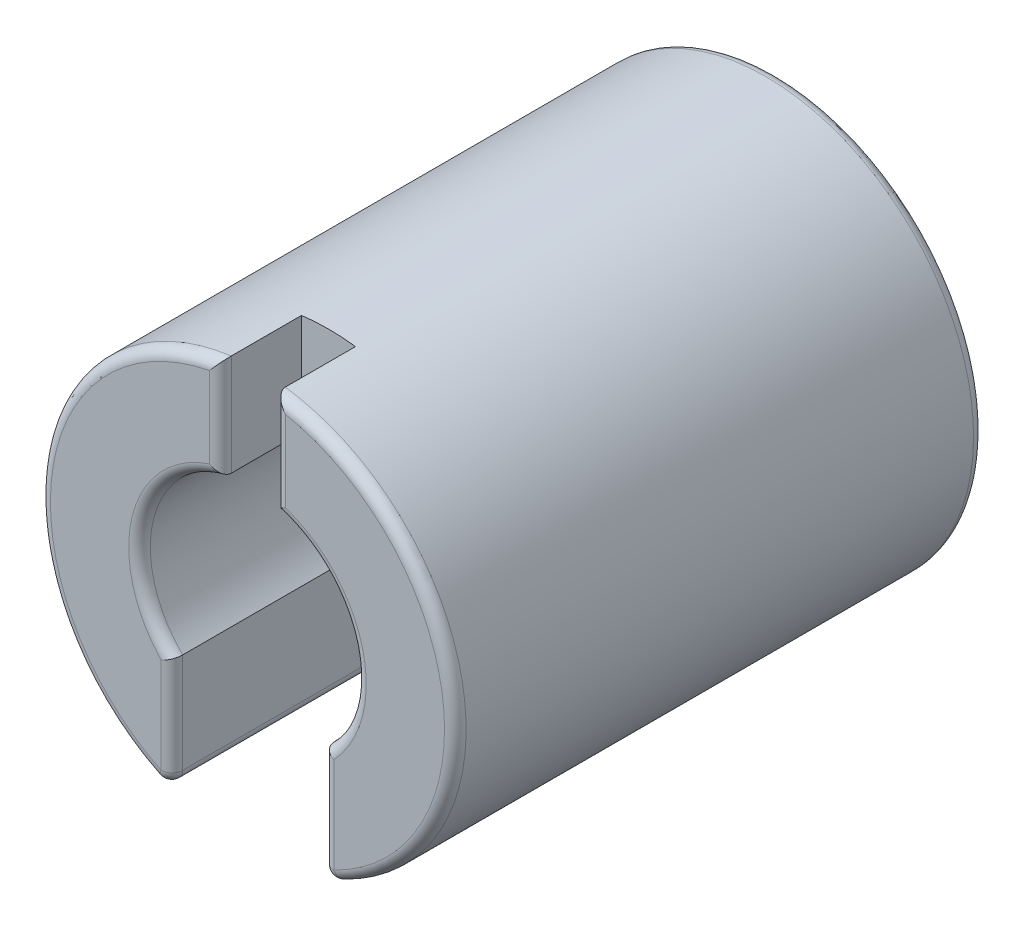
ISO-10303-21;
HEADER;
FILE_DESCRIPTION(('STEP AP214'),'2;1');
FILE_NAME('part.step','',(''),(''),'','','');
FILE_SCHEMA(('AUTOMOTIVE_DESIGN { 1 0 10303 214 1 1 1 1 }'));
ENDSEC;
DATA;
#1=APPLICATION_CONTEXT('core data for automotive mechanical design processes');
#2=APPLICATION_PROTOCOL_DEFINITION('international standard','automotive_design',2000,#1);
#3=PRODUCT_CONTEXT('',#1,'mechanical');
#4=PRODUCT('Part','Part','',(#3));
#5=PRODUCT_RELATED_PRODUCT_CATEGORY('part','',(#4));
#6=PRODUCT_DEFINITION_FORMATION('','',#4);
#7=PRODUCT_DEFINITION_CONTEXT('part definition',#1,'design');
#8=PRODUCT_DEFINITION('design','',#6,#7);
#9=PRODUCT_DEFINITION_SHAPE('','',#8);
#10=(LENGTH_UNIT() NAMED_UNIT(*) SI_UNIT(.MILLI.,.METRE.));
#11=(NAMED_UNIT(*) PLANE_ANGLE_UNIT() SI_UNIT($,.RADIAN.));
#12=(NAMED_UNIT(*) SI_UNIT($,.STERADIAN.) SOLID_ANGLE_UNIT());
#13=UNCERTAINTY_MEASURE_WITH_UNIT(LENGTH_MEASURE(1.E-05),#10,'distance_accuracy_value','');
#14=(GEOMETRIC_REPRESENTATION_CONTEXT(3) GLOBAL_UNCERTAINTY_ASSIGNED_CONTEXT((#13)) GLOBAL_UNIT_ASSIGNED_CONTEXT((#10,
#11,#12)) REPRESENTATION_CONTEXT('',''));
#15=CARTESIAN_POINT('',(0.,0.,0.));
#16=DIRECTION('',(0.,0.,1.));
#17=DIRECTION('',(1.,0.,0.));
#18=AXIS2_PLACEMENT_3D('',#15,#16,#17);
#19=CARTESIAN_POINT('',(0.,0.,9.8));
#20=DIRECTION('',(0.,0.,-1.));
#21=DIRECTION('',(-1.,0.,0.));
#22=AXIS2_PLACEMENT_3D('',#19,#20,#21);
#23=CYLINDRICAL_SURFACE('',#22,2.);
#24=DIRECTION('',(0.,0.,-1.));
#25=VECTOR('',#24,1.);
#26=CARTESIAN_POINT('',(1.4,-1.42828568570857,9.8));
#27=LINE('',#26,#25);
#28=CARTESIAN_POINT('',(1.4,-1.42828568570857,9.6));
#29=VERTEX_POINT('',#28);
#30=CARTESIAN_POINT('',(1.4,-1.42828568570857,0.));
#31=VERTEX_POINT('',#30);
#32=EDGE_CURVE('E213',#29,#31,#27,.T.);
#33=ORIENTED_EDGE('',*,*,#32,.F.);
#34=CARTESIAN_POINT('',(0.,0.,9.6));
#35=DIRECTION('',(0.,0.,1.));
#36=DIRECTION('',(1.,0.,0.));
#37=AXIS2_PLACEMENT_3D('',#34,#35,#36);
#38=CIRCLE('',#37,2.);
#39=CARTESIAN_POINT('',(0.5,1.93649167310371,9.6));
#40=VERTEX_POINT('',#39);
#41=EDGE_CURVE('E263',#29,#40,#38,.T.);
#42=ORIENTED_EDGE('',*,*,#41,.T.);
#43=DIRECTION('',(0.,0.,1.));
#44=VECTOR('',#43,1.);
#45=CARTESIAN_POINT('',(0.5,1.93649167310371,8.3));
#46=LINE('',#45,#44);
#47=CARTESIAN_POINT('',(0.5,1.93649167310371,0.));
#48=VERTEX_POINT('',#47);
#49=EDGE_CURVE('E432',#48,#40,#46,.T.);
#50=ORIENTED_EDGE('',*,*,#49,.F.);
#51=CARTESIAN_POINT('',(0.,0.,0.));
#52=DIRECTION('',(0.,0.,-1.));
#53=DIRECTION('',(1.,0.,0.));
#54=AXIS2_PLACEMENT_3D('',#51,#52,#53);
#55=CIRCLE('',#54,2.);
#56=EDGE_CURVE('E210',#48,#31,#55,.T.);
#57=ORIENTED_EDGE('',*,*,#56,.T.);
#58=EDGE_LOOP('',(#33,#42,#50,#57));
#59=FACE_BOUND('',#58,.T.);
#60=ADVANCED_FACE('F36',(#59),#23,.F.);
#61=CARTESIAN_POINT('',(0.,0.,9.8));
#62=DIRECTION('',(0.,0.,1.));
#63=DIRECTION('',(1.,0.,0.));
#64=AXIS2_PLACEMENT_3D('',#61,#62,#63);
#65=PLANE('',#64);
#66=DIRECTION('',(0.,1.,0.));
#67=VECTOR('',#66,1.);
#68=CARTESIAN_POINT('',(-1.6,-1.42828568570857,9.8));
#69=LINE('',#68,#67);
#70=CARTESIAN_POINT('',(-1.59999999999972,-3.28062494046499,9.8));
#71=VERTEX_POINT('',#70);
#72=CARTESIAN_POINT('',(-1.6,-1.50996688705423,9.8));
#73=VERTEX_POINT('',#72);
#74=EDGE_CURVE('E228',#71,#73,#69,.T.);
#75=ORIENTED_EDGE('',*,*,#74,.T.);
#76=CARTESIAN_POINT('',(0.,0.,9.8));
#77=DIRECTION('',(0.,0.,1.));
#78=DIRECTION('',(1.,0.,0.));
#79=AXIS2_PLACEMENT_3D('',#76,#77,#78);
#80=CIRCLE('',#79,2.2);
#81=CARTESIAN_POINT('',(-0.7,2.08566536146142,9.8));
#82=VERTEX_POINT('',#81);
#83=EDGE_CURVE('E230',#73,#82,#80,.F.);
#84=ORIENTED_EDGE('',*,*,#83,.T.);
#85=DIRECTION('',(0.,-1.,0.));
#86=VECTOR('',#85,1.);
#87=CARTESIAN_POINT('',(-0.7,3.81739439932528,9.8));
#88=LINE('',#87,#86);
#89=CARTESIAN_POINT('',(-0.7,3.58224789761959,9.8));
#90=VERTEX_POINT('',#89);
#91=EDGE_CURVE('E224',#82,#90,#88,.F.);
#92=ORIENTED_EDGE('',*,*,#91,.T.);
#93=CARTESIAN_POINT('',(0.,0.,9.8));
#94=DIRECTION('',(0.,0.,1.));
#95=DIRECTION('',(1.,0.,0.));
#96=AXIS2_PLACEMENT_3D('',#93,#94,#95);
#97=CIRCLE('',#96,3.65);
#98=EDGE_CURVE('E226',#90,#71,#97,.T.);
#99=ORIENTED_EDGE('',*,*,#98,.T.);
#100=EDGE_LOOP('',(#75,#84,#92,#99));
#101=FACE_BOUND('',#100,.T.);
#102=ADVANCED_FACE('F377',(#101),#65,.T.);
#103=CARTESIAN_POINT('',(0.,0.,9.8));
#104=DIRECTION('',(0.,0.,-1.));
#105=DIRECTION('',(-1.,0.,0.));
#106=AXIS2_PLACEMENT_3D('',#103,#104,#105);
#107=CYLINDRICAL_SURFACE('',#106,3.85);
#108=DIRECTION('',(0.,0.,-1.));
#109=VECTOR('',#108,1.);
#110=CARTESIAN_POINT('',(-1.68767123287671,-3.46038521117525,9.8));
#111=LINE('',#110,#109);
#112=CARTESIAN_POINT('',(-1.68767123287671,-3.46038521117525,0.200000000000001));
#113=VERTEX_POINT('',#112);
#114=CARTESIAN_POINT('',(-1.68767123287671,-3.46038521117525,9.6));
#115=VERTEX_POINT('',#114);
#116=EDGE_CURVE('E241',#113,#115,#111,.F.);
#117=ORIENTED_EDGE('',*,*,#116,.T.);
#118=CARTESIAN_POINT('',(0.,0.,9.6));
#119=DIRECTION('',(0.,0.,1.));
#120=DIRECTION('',(1.,0.,0.));
#121=AXIS2_PLACEMENT_3D('',#118,#119,#120);
#122=CIRCLE('',#121,3.85);
#123=CARTESIAN_POINT('',(-0.5,3.81739439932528,9.6));
#124=VERTEX_POINT('',#123);
#125=EDGE_CURVE('E247',#115,#124,#122,.F.);
#126=ORIENTED_EDGE('',*,*,#125,.T.);
#127=DIRECTION('',(0.,0.,1.));
#128=VECTOR('',#127,1.);
#129=CARTESIAN_POINT('',(-0.5,3.81739439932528,8.3));
#130=LINE('',#129,#128);
#131=CARTESIAN_POINT('',(-0.5,3.81739439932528,8.3));
#132=VERTEX_POINT('',#131);
#133=EDGE_CURVE('E196',#132,#124,#130,.T.);
#134=ORIENTED_EDGE('',*,*,#133,.F.);
#135=CARTESIAN_POINT('',(0.,0.,8.3));
#136=DIRECTION('',(0.,0.,1.));
#137=DIRECTION('',(1.,0.,0.));
#138=AXIS2_PLACEMENT_3D('',#135,#136,#137);
#139=CIRCLE('',#138,3.85);
#140=CARTESIAN_POINT('',(0.5,3.81739439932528,8.3));
#141=VERTEX_POINT('',#140);
#142=EDGE_CURVE('E439',#141,#132,#139,.T.);
#143=ORIENTED_EDGE('',*,*,#142,.F.);
#144=DIRECTION('',(0.,0.,1.));
#145=VECTOR('',#144,1.);
#146=CARTESIAN_POINT('',(0.5,3.81739439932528,8.3));
#147=LINE('',#146,#145);
#148=CARTESIAN_POINT('',(0.5,3.81739439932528,9.6));
#149=VERTEX_POINT('',#148);
#150=EDGE_CURVE('E429',#141,#149,#147,.T.);
#151=ORIENTED_EDGE('',*,*,#150,.T.);
#152=CARTESIAN_POINT('',(0.,0.,9.6));
#153=DIRECTION('',(0.,0.,1.));
#154=DIRECTION('',(1.,0.,0.));
#155=AXIS2_PLACEMENT_3D('',#152,#153,#154);
#156=CIRCLE('',#155,3.85);
#157=CARTESIAN_POINT('',(1.68767123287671,-3.46038521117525,9.6));
#158=VERTEX_POINT('',#157);
#159=EDGE_CURVE('E245',#149,#158,#156,.F.);
#160=ORIENTED_EDGE('',*,*,#159,.T.);
#161=DIRECTION('',(0.,0.,-1.));
#162=VECTOR('',#161,1.);
#163=CARTESIAN_POINT('',(1.68767123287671,-3.46038521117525,9.8));
#164=LINE('',#163,#162);
#165=CARTESIAN_POINT('',(1.68767123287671,-3.46038521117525,0.200000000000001));
#166=VERTEX_POINT('',#165);
#167=EDGE_CURVE('E243',#158,#166,#164,.T.);
#168=ORIENTED_EDGE('',*,*,#167,.T.);
#169=CARTESIAN_POINT('',(0.,0.,0.200000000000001));
#170=DIRECTION('',(0.,0.,1.));
#171=DIRECTION('',(1.,0.,0.));
#172=AXIS2_PLACEMENT_3D('',#169,#170,#171);
#173=CIRCLE('',#172,3.85);
#174=EDGE_CURVE('E239',#166,#113,#173,.T.);
#175=ORIENTED_EDGE('',*,*,#174,.T.);
#176=EDGE_LOOP('',(#117,#126,#134,#143,#151,#160,#168,#175));
#177=FACE_BOUND('',#176,.T.);
#178=ADVANCED_FACE('F383',(#177),#107,.T.);
#179=CARTESIAN_POINT('',(-1.4,-3.58643276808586,9.8));
#180=DIRECTION('',(-1.,0.,0.));
#181=DIRECTION('',(0.,0.,1.));
#182=AXIS2_PLACEMENT_3D('',#179,#180,#181);
#183=PLANE('',#182);
#184=DIRECTION('',(0.,0.,-1.));
#185=VECTOR('',#184,1.);
#186=CARTESIAN_POINT('',(-1.4,-1.42828568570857,9.8));
#187=LINE('',#186,#185);
#188=CARTESIAN_POINT('',(-1.4,-1.42828568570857,9.6));
#189=VERTEX_POINT('',#188);
#190=CARTESIAN_POINT('',(-1.4,-1.42828568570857,0.));
#191=VERTEX_POINT('',#190);
#192=EDGE_CURVE('E208',#189,#191,#187,.T.);
#193=ORIENTED_EDGE('',*,*,#192,.F.);
#194=DIRECTION('',(0.,1.,0.));
#195=VECTOR('',#194,1.);
#196=CARTESIAN_POINT('',(-1.4,-3.58643276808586,9.6));
#197=LINE('',#196,#195);
#198=CARTESIAN_POINT('',(-1.4,-3.28062494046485,9.6));
#199=VERTEX_POINT('',#198);
#200=EDGE_CURVE('E237',#189,#199,#197,.F.);
#201=ORIENTED_EDGE('',*,*,#200,.T.);
#202=DIRECTION('',(0.,0.,-1.));
#203=VECTOR('',#202,1.);
#204=CARTESIAN_POINT('',(-1.4,-3.28062494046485,9.8));
#205=LINE('',#204,#203);
#206=CARTESIAN_POINT('',(-1.4,-3.28062494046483,0.));
#207=VERTEX_POINT('',#206);
#208=EDGE_CURVE('E235',#199,#207,#205,.T.);
#209=ORIENTED_EDGE('',*,*,#208,.T.);
#210=DIRECTION('',(0.,1.,0.));
#211=VECTOR('',#210,1.);
#212=CARTESIAN_POINT('',(-1.4,-3.58643276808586,0.));
#213=LINE('',#212,#211);
#214=EDGE_CURVE('E195',#207,#191,#213,.T.);
#215=ORIENTED_EDGE('',*,*,#214,.T.);
#216=EDGE_LOOP('',(#193,#201,#209,#215));
#217=FACE_BOUND('',#216,.T.);
#218=ADVANCED_FACE('F392',(#217),#183,.F.);
#219=DIRECTION('',(0.,0.,1.));
#220=VECTOR('',#219,1.);
#221=CARTESIAN_POINT('',(-0.5,1.93649167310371,8.3));
#222=LINE('',#221,#220);
#223=CARTESIAN_POINT('',(-0.5,1.93649167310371,0.));
#224=VERTEX_POINT('',#223);
#225=CARTESIAN_POINT('',(-0.5,1.93649167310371,9.6));
#226=VERTEX_POINT('',#225);
#227=EDGE_CURVE('E183',#224,#226,#222,.T.);
#228=ORIENTED_EDGE('',*,*,#227,.T.);
#229=CARTESIAN_POINT('',(0.,0.,9.6));
#230=DIRECTION('',(0.,0.,1.));
#231=DIRECTION('',(1.,0.,0.));
#232=AXIS2_PLACEMENT_3D('',#229,#230,#231);
#233=CIRCLE('',#232,2.);
#234=EDGE_CURVE('E233',#226,#189,#233,.T.);
#235=ORIENTED_EDGE('',*,*,#234,.T.);
#236=ORIENTED_EDGE('',*,*,#192,.T.);
#237=EDGE_CURVE('E200',#191,#224,#55,.T.);
#238=ORIENTED_EDGE('',*,*,#237,.T.);
#239=EDGE_LOOP('',(#228,#235,#236,#238));
#240=FACE_BOUND('',#239,.T.);
#241=ADVANCED_FACE('F206',(#240),#23,.F.);
#242=CARTESIAN_POINT('',(1.4,-3.58643276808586,9.8));
#243=DIRECTION('',(1.,0.,0.));
#244=DIRECTION('',(0.,0.,-1.));
#245=AXIS2_PLACEMENT_3D('',#242,#243,#244);
#246=PLANE('',#245);
#247=DIRECTION('',(0.,0.,-1.));
#248=VECTOR('',#247,1.);
#249=CARTESIAN_POINT('',(1.4,-3.28062494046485,9.8));
#250=LINE('',#249,#248);
#251=CARTESIAN_POINT('',(1.4,-3.28062494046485,0.));
#252=VERTEX_POINT('',#251);
#253=CARTESIAN_POINT('',(1.4,-3.28062494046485,9.6));
#254=VERTEX_POINT('',#253);
#255=EDGE_CURVE('E259',#252,#254,#250,.F.);
#256=ORIENTED_EDGE('',*,*,#255,.T.);
#257=DIRECTION('',(0.,-1.,0.));
#258=VECTOR('',#257,1.);
#259=CARTESIAN_POINT('',(1.4,-1.42828568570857,9.6));
#260=LINE('',#259,#258);
#261=EDGE_CURVE('E261',#254,#29,#260,.F.);
#262=ORIENTED_EDGE('',*,*,#261,.T.);
#263=ORIENTED_EDGE('',*,*,#32,.T.);
#264=DIRECTION('',(0.,-1.,0.));
#265=VECTOR('',#264,1.);
#266=CARTESIAN_POINT('',(1.4,-3.58643276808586,0.));
#267=LINE('',#266,#265);
#268=EDGE_CURVE('E209',#31,#252,#267,.T.);
#269=ORIENTED_EDGE('',*,*,#268,.T.);
#270=EDGE_LOOP('',(#256,#262,#263,#269));
#271=FACE_BOUND('',#270,.T.);
#272=ADVANCED_FACE('F391',(#271),#246,.F.);
#273=DIRECTION('',(0.,-1.,0.));
#274=VECTOR('',#273,1.);
#275=CARTESIAN_POINT('',(1.6,-3.58643276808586,9.8));
#276=LINE('',#275,#274);
#277=CARTESIAN_POINT('',(1.59999999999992,-1.50996688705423,9.8));
#278=VERTEX_POINT('',#277);
#279=CARTESIAN_POINT('',(1.6,-3.28062494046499,9.8));
#280=VERTEX_POINT('',#279);
#281=EDGE_CURVE('E254',#278,#280,#276,.T.);
#282=ORIENTED_EDGE('',*,*,#281,.T.);
#283=CARTESIAN_POINT('',(0.,0.,9.8));
#284=DIRECTION('',(0.,0.,1.));
#285=DIRECTION('',(1.,0.,0.));
#286=AXIS2_PLACEMENT_3D('',#283,#284,#285);
#287=CIRCLE('',#286,3.65);
#288=CARTESIAN_POINT('',(0.7,3.58224789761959,9.8));
#289=VERTEX_POINT('',#288);
#290=EDGE_CURVE('E256',#280,#289,#287,.T.);
#291=ORIENTED_EDGE('',*,*,#290,.T.);
#292=DIRECTION('',(0.,1.,0.));
#293=VECTOR('',#292,1.);
#294=CARTESIAN_POINT('',(0.7,1.93649167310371,9.8));
#295=LINE('',#294,#293);
#296=CARTESIAN_POINT('',(0.7,2.08566536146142,9.8));
#297=VERTEX_POINT('',#296);
#298=EDGE_CURVE('E250',#289,#297,#295,.F.);
#299=ORIENTED_EDGE('',*,*,#298,.T.);
#300=CARTESIAN_POINT('',(0.,0.,9.8));
#301=DIRECTION('',(0.,0.,1.));
#302=DIRECTION('',(1.,0.,0.));
#303=AXIS2_PLACEMENT_3D('',#300,#301,#302);
#304=CIRCLE('',#303,2.2);
#305=EDGE_CURVE('E252',#297,#278,#304,.F.);
#306=ORIENTED_EDGE('',*,*,#305,.T.);
#307=EDGE_LOOP('',(#282,#291,#299,#306));
#308=FACE_BOUND('',#307,.T.);
#309=ADVANCED_FACE('F386',(#308),#65,.T.);
#310=CARTESIAN_POINT('',(0.,0.,0.));
#311=DIRECTION('',(0.,0.,1.));
#312=DIRECTION('',(1.,0.,0.));
#313=AXIS2_PLACEMENT_3D('',#310,#311,#312);
#314=PLANE('',#313);
#315=DIRECTION('',(-0.707106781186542,0.707106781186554,0.));
#316=VECTOR('',#315,1.);
#317=CARTESIAN_POINT('',(1.76776695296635,-1.76776695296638,0.));
#318=LINE('',#317,#316);
#319=CARTESIAN_POINT('',(2.4748737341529,-2.47487373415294,0.));
#320=VERTEX_POINT('',#319);
#321=CARTESIAN_POINT('',(1.76776695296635,-1.76776695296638,0.));
#322=VERTEX_POINT('',#321);
#323=EDGE_CURVE('E463',#320,#322,#318,.T.);
#324=ORIENTED_EDGE('',*,*,#323,.F.);
#325=CARTESIAN_POINT('',(0.,0.,0.));
#326=DIRECTION('',(0.,0.,-1.));
#327=DIRECTION('',(-1.,0.,0.));
#328=AXIS2_PLACEMENT_3D('',#325,#326,#327);
#329=CIRCLE('',#328,3.5);
#330=CARTESIAN_POINT('',(-2.47487373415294,-2.4748737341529,0.));
#331=VERTEX_POINT('',#330);
#332=EDGE_CURVE('E466',#331,#320,#329,.T.);
#333=ORIENTED_EDGE('',*,*,#332,.F.);
#334=DIRECTION('',(-0.707106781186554,-0.707106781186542,0.));
#335=VECTOR('',#334,1.);
#336=CARTESIAN_POINT('',(-1.76776695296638,-1.76776695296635,0.));
#337=LINE('',#336,#335);
#338=CARTESIAN_POINT('',(-1.76776695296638,-1.76776695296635,0.));
#339=VERTEX_POINT('',#338);
#340=EDGE_CURVE('E456',#339,#331,#337,.T.);
#341=ORIENTED_EDGE('',*,*,#340,.F.);
#342=CARTESIAN_POINT('',(0.,0.,0.));
#343=DIRECTION('',(0.,0.,1.));
#344=DIRECTION('',(-1.,0.,0.));
#345=AXIS2_PLACEMENT_3D('',#342,#343,#344);
#346=CIRCLE('',#345,2.5);
#347=EDGE_CURVE('E460',#322,#339,#346,.T.);
#348=ORIENTED_EDGE('',*,*,#347,.F.);
#349=EDGE_LOOP('',(#324,#333,#341,#348));
#350=FACE_BOUND('',#349,.T.);
#351=CARTESIAN_POINT('',(0.,0.,0.));
#352=DIRECTION('',(0.,0.,1.));
#353=DIRECTION('',(1.,0.,0.));
#354=AXIS2_PLACEMENT_3D('',#351,#352,#353);
#355=CIRCLE('',#354,3.65);
#356=CARTESIAN_POINT('',(-1.41790525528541,-3.36333832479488,0.));
#357=VERTEX_POINT('',#356);
#358=CARTESIAN_POINT('',(1.41790525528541,-3.36333832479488,0.));
#359=VERTEX_POINT('',#358);
#360=EDGE_CURVE('E57',#357,#359,#355,.F.);
#361=ORIENTED_EDGE('',*,*,#360,.T.);
#362=CARTESIAN_POINT('',(1.6,-3.28062494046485,0.));
#363=DIRECTION('',(0.,0.,1.));
#364=DIRECTION('',(1.,0.,0.));
#365=AXIS2_PLACEMENT_3D('',#362,#363,#364);
#366=CIRCLE('',#365,0.2);
#367=EDGE_CURVE('E11',#359,#252,#366,.F.);
#368=ORIENTED_EDGE('',*,*,#367,.T.);
#369=ORIENTED_EDGE('',*,*,#268,.F.);
#370=ORIENTED_EDGE('',*,*,#56,.F.);
#371=DIRECTION('',(0.,-1.,0.));
#372=VECTOR('',#371,1.);
#373=CARTESIAN_POINT('',(0.5,1.93649167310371,0.));
#374=LINE('',#373,#372);
#375=CARTESIAN_POINT('',(0.5,2.24499443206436,0.));
#376=VERTEX_POINT('',#375);
#377=EDGE_CURVE('E481',#376,#48,#374,.T.);
#378=ORIENTED_EDGE('',*,*,#377,.F.);
#379=CARTESIAN_POINT('',(0.,0.,0.));
#380=DIRECTION('',(0.,0.,-1.));
#381=DIRECTION('',(-1.,0.,0.));
#382=AXIS2_PLACEMENT_3D('',#379,#380,#381);
#383=CIRCLE('',#382,2.3);
#384=CARTESIAN_POINT('',(-0.5,2.24499443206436,0.));
#385=VERTEX_POINT('',#384);
#386=EDGE_CURVE('E203',#385,#376,#383,.T.);
#387=ORIENTED_EDGE('',*,*,#386,.F.);
#388=DIRECTION('',(0.,1.,0.));
#389=VECTOR('',#388,1.);
#390=CARTESIAN_POINT('',(-0.5,1.93649167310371,0.));
#391=LINE('',#390,#389);
#392=EDGE_CURVE('E187',#224,#385,#391,.T.);
#393=ORIENTED_EDGE('',*,*,#392,.F.);
#394=ORIENTED_EDGE('',*,*,#237,.F.);
#395=ORIENTED_EDGE('',*,*,#214,.F.);
#396=CARTESIAN_POINT('',(-1.6,-3.28062494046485,0.));
#397=DIRECTION('',(0.,0.,1.));
#398=DIRECTION('',(1.,0.,0.));
#399=AXIS2_PLACEMENT_3D('',#396,#397,#398);
#400=CIRCLE('',#399,0.2);
#401=EDGE_CURVE('E50',#207,#357,#400,.F.);
#402=ORIENTED_EDGE('',*,*,#401,.T.);
#403=EDGE_LOOP('',(#361,#368,#369,#370,#378,#387,#393,#394,#395,#402));
#404=FACE_BOUND('',#403,.T.);
#405=ADVANCED_FACE('F199',(#350,#404),#314,.F.);
#406=CARTESIAN_POINT('',(-0.5,1.93649167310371,8.3));
#407=DIRECTION('',(-1.,0.,0.));
#408=DIRECTION('',(0.,0.,1.));
#409=AXIS2_PLACEMENT_3D('',#406,#407,#408);
#410=PLANE('',#409);
#411=ORIENTED_EDGE('',*,*,#133,.T.);
#412=DIRECTION('',(0.,-1.,0.));
#413=VECTOR('',#412,1.);
#414=CARTESIAN_POINT('',(-0.5,1.93649167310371,9.6));
#415=LINE('',#414,#413);
#416=EDGE_CURVE('E190',#124,#226,#415,.T.);
#417=ORIENTED_EDGE('',*,*,#416,.T.);
#418=ORIENTED_EDGE('',*,*,#227,.F.);
#419=ORIENTED_EDGE('',*,*,#392,.T.);
#420=DIRECTION('',(0.,0.,-1.));
#421=VECTOR('',#420,1.);
#422=CARTESIAN_POINT('',(-0.5,2.24499443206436,9.8));
#423=LINE('',#422,#421);
#424=CARTESIAN_POINT('',(-0.5,2.24499443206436,8.3));
#425=VERTEX_POINT('',#424);
#426=EDGE_CURVE('E479',#425,#385,#423,.T.);
#427=ORIENTED_EDGE('',*,*,#426,.F.);
#428=DIRECTION('',(0.,-1.,0.));
#429=VECTOR('',#428,1.);
#430=CARTESIAN_POINT('',(-0.5,1.93649167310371,8.3));
#431=LINE('',#430,#429);
#432=EDGE_CURVE('E428',#132,#425,#431,.T.);
#433=ORIENTED_EDGE('',*,*,#432,.F.);
#434=EDGE_LOOP('',(#411,#417,#418,#419,#427,#433));
#435=FACE_BOUND('',#434,.T.);
#436=ADVANCED_FACE('F186',(#435),#410,.F.);
#437=CARTESIAN_POINT('',(0.5,1.93649167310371,8.3));
#438=DIRECTION('',(1.,0.,0.));
#439=DIRECTION('',(0.,0.,-1.));
#440=AXIS2_PLACEMENT_3D('',#437,#438,#439);
#441=PLANE('',#440);
#442=ORIENTED_EDGE('',*,*,#49,.T.);
#443=DIRECTION('',(0.,1.,0.));
#444=VECTOR('',#443,1.);
#445=CARTESIAN_POINT('',(0.5,3.81739439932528,9.6));
#446=LINE('',#445,#444);
#447=EDGE_CURVE('E265',#40,#149,#446,.T.);
#448=ORIENTED_EDGE('',*,*,#447,.T.);
#449=ORIENTED_EDGE('',*,*,#150,.F.);
#450=DIRECTION('',(0.,1.,0.));
#451=VECTOR('',#450,1.);
#452=CARTESIAN_POINT('',(0.5,1.93649167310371,8.3));
#453=LINE('',#452,#451);
#454=CARTESIAN_POINT('',(0.5,2.24499443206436,8.3));
#455=VERTEX_POINT('',#454);
#456=EDGE_CURVE('E442',#455,#141,#453,.T.);
#457=ORIENTED_EDGE('',*,*,#456,.F.);
#458=DIRECTION('',(0.,0.,-1.));
#459=VECTOR('',#458,1.);
#460=CARTESIAN_POINT('',(0.5,2.24499443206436,9.8));
#461=LINE('',#460,#459);
#462=EDGE_CURVE('E468',#455,#376,#461,.T.);
#463=ORIENTED_EDGE('',*,*,#462,.T.);
#464=ORIENTED_EDGE('',*,*,#377,.T.);
#465=EDGE_LOOP('',(#442,#448,#449,#457,#463,#464));
#466=FACE_BOUND('',#465,.T.);
#467=ADVANCED_FACE('F486',(#466),#441,.F.);
#468=CARTESIAN_POINT('',(0.,0.,8.3));
#469=DIRECTION('',(0.,0.,1.));
#470=DIRECTION('',(1.,0.,0.));
#471=AXIS2_PLACEMENT_3D('',#468,#469,#470);
#472=PLANE('',#471);
#473=CARTESIAN_POINT('',(0.,0.,8.3));
#474=DIRECTION('',(0.,0.,1.));
#475=DIRECTION('',(1.,0.,0.));
#476=AXIS2_PLACEMENT_3D('',#473,#474,#475);
#477=CIRCLE('',#476,2.3);
#478=EDGE_CURVE('E221',#455,#425,#477,.T.);
#479=ORIENTED_EDGE('',*,*,#478,.F.);
#480=ORIENTED_EDGE('',*,*,#456,.T.);
#481=ORIENTED_EDGE('',*,*,#142,.T.);
#482=ORIENTED_EDGE('',*,*,#432,.T.);
#483=EDGE_LOOP('',(#479,#480,#481,#482));
#484=FACE_BOUND('',#483,.T.);
#485=ADVANCED_FACE('F489',(#484),#472,.T.);
#486=CARTESIAN_POINT('',(0.,0.,1.5));
#487=DIRECTION('',(0.,0.,-1.));
#488=DIRECTION('',(-1.,0.,0.));
#489=AXIS2_PLACEMENT_3D('',#486,#487,#488);
#490=CYLINDRICAL_SURFACE('',#489,3.5);
#491=ORIENTED_EDGE('',*,*,#332,.T.);
#492=DIRECTION('',(0.,0.,-1.));
#493=VECTOR('',#492,1.);
#494=CARTESIAN_POINT('',(2.4748737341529,-2.47487373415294,1.5));
#495=LINE('',#494,#493);
#496=CARTESIAN_POINT('',(2.4748737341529,-2.47487373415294,1.5));
#497=VERTEX_POINT('',#496);
#498=EDGE_CURVE('E447',#497,#320,#495,.T.);
#499=ORIENTED_EDGE('',*,*,#498,.F.);
#500=CARTESIAN_POINT('',(0.,0.,1.5));
#501=DIRECTION('',(0.,0.,-1.));
#502=DIRECTION('',(-1.,0.,0.));
#503=AXIS2_PLACEMENT_3D('',#500,#501,#502);
#504=CIRCLE('',#503,3.5);
#505=CARTESIAN_POINT('',(-2.47487373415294,-2.4748737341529,1.5));
#506=VERTEX_POINT('',#505);
#507=EDGE_CURVE('E459',#506,#497,#504,.T.);
#508=ORIENTED_EDGE('',*,*,#507,.F.);
#509=DIRECTION('',(0.,0.,-1.));
#510=VECTOR('',#509,1.);
#511=CARTESIAN_POINT('',(-2.47487373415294,-2.4748737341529,1.5));
#512=LINE('',#511,#510);
#513=EDGE_CURVE('E446',#506,#331,#512,.T.);
#514=ORIENTED_EDGE('',*,*,#513,.T.);
#515=EDGE_LOOP('',(#491,#499,#508,#514));
#516=FACE_BOUND('',#515,.T.);
#517=ADVANCED_FACE('F525',(#516),#490,.F.);
#518=CARTESIAN_POINT('',(-1.76776695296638,-1.76776695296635,1.5));
#519=DIRECTION('',(0.707106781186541,-0.707106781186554,0.));
#520=DIRECTION('',(0.707106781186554,0.707106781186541,0.));
#521=AXIS2_PLACEMENT_3D('',#518,#519,#520);
#522=PLANE('',#521);
#523=ORIENTED_EDGE('',*,*,#340,.T.);
#524=ORIENTED_EDGE('',*,*,#513,.F.);
#525=DIRECTION('',(-0.707106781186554,-0.707106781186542,0.));
#526=VECTOR('',#525,1.);
#527=CARTESIAN_POINT('',(-1.76776695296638,-1.76776695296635,1.5));
#528=LINE('',#527,#526);
#529=CARTESIAN_POINT('',(-1.76776695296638,-1.76776695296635,1.5));
#530=VERTEX_POINT('',#529);
#531=EDGE_CURVE('E451',#530,#506,#528,.T.);
#532=ORIENTED_EDGE('',*,*,#531,.F.);
#533=DIRECTION('',(0.,0.,-1.));
#534=VECTOR('',#533,1.);
#535=CARTESIAN_POINT('',(-1.76776695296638,-1.76776695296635,1.5));
#536=LINE('',#535,#534);
#537=EDGE_CURVE('E453',#530,#339,#536,.T.);
#538=ORIENTED_EDGE('',*,*,#537,.T.);
#539=EDGE_LOOP('',(#523,#524,#532,#538));
#540=FACE_BOUND('',#539,.T.);
#541=ADVANCED_FACE('F528',(#540),#522,.F.);
#542=CARTESIAN_POINT('',(0.,0.,1.5));
#543=DIRECTION('',(0.,0.,-1.));
#544=DIRECTION('',(-1.,0.,0.));
#545=AXIS2_PLACEMENT_3D('',#542,#543,#544);
#546=CYLINDRICAL_SURFACE('',#545,2.5);
#547=ORIENTED_EDGE('',*,*,#347,.T.);
#548=ORIENTED_EDGE('',*,*,#537,.F.);
#549=CARTESIAN_POINT('',(0.,0.,1.5));
#550=DIRECTION('',(0.,0.,1.));
#551=DIRECTION('',(-1.,0.,0.));
#552=AXIS2_PLACEMENT_3D('',#549,#550,#551);
#553=CIRCLE('',#552,2.5);
#554=CARTESIAN_POINT('',(1.76776695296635,-1.76776695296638,1.5));
#555=VERTEX_POINT('',#554);
#556=EDGE_CURVE('E471',#555,#530,#553,.T.);
#557=ORIENTED_EDGE('',*,*,#556,.F.);
#558=DIRECTION('',(0.,0.,-1.));
#559=VECTOR('',#558,1.);
#560=CARTESIAN_POINT('',(1.76776695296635,-1.76776695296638,1.5));
#561=LINE('',#560,#559);
#562=EDGE_CURVE('E450',#555,#322,#561,.T.);
#563=ORIENTED_EDGE('',*,*,#562,.T.);
#564=EDGE_LOOP('',(#547,#548,#557,#563));
#565=FACE_BOUND('',#564,.T.);
#566=ADVANCED_FACE('F533',(#565),#546,.T.);
#567=CARTESIAN_POINT('',(1.76776695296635,-1.76776695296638,1.5));
#568=DIRECTION('',(-0.707106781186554,-0.707106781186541,0.));
#569=DIRECTION('',(0.707106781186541,-0.707106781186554,0.));
#570=AXIS2_PLACEMENT_3D('',#567,#568,#569);
#571=PLANE('',#570);
#572=ORIENTED_EDGE('',*,*,#323,.T.);
#573=ORIENTED_EDGE('',*,*,#562,.F.);
#574=DIRECTION('',(-0.707106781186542,0.707106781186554,0.));
#575=VECTOR('',#574,1.);
#576=CARTESIAN_POINT('',(1.76776695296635,-1.76776695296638,1.5));
#577=LINE('',#576,#575);
#578=EDGE_CURVE('E474',#497,#555,#577,.T.);
#579=ORIENTED_EDGE('',*,*,#578,.F.);
#580=ORIENTED_EDGE('',*,*,#498,.T.);
#581=EDGE_LOOP('',(#572,#573,#579,#580));
#582=FACE_BOUND('',#581,.T.);
#583=ADVANCED_FACE('F530',(#582),#571,.F.);
#584=CARTESIAN_POINT('',(0.,0.,1.5));
#585=DIRECTION('',(0.,0.,-1.));
#586=DIRECTION('',(-1.,0.,0.));
#587=AXIS2_PLACEMENT_3D('',#584,#585,#586);
#588=PLANE('',#587);
#589=ORIENTED_EDGE('',*,*,#507,.T.);
#590=ORIENTED_EDGE('',*,*,#578,.T.);
#591=ORIENTED_EDGE('',*,*,#556,.T.);
#592=ORIENTED_EDGE('',*,*,#531,.T.);
#593=EDGE_LOOP('',(#589,#590,#591,#592));
#594=FACE_BOUND('',#593,.T.);
#595=ADVANCED_FACE('F372',(#594),#588,.T.);
#596=CARTESIAN_POINT('',(0.,0.,9.8));
#597=DIRECTION('',(0.,0.,-1.));
#598=DIRECTION('',(-1.,0.,0.));
#599=AXIS2_PLACEMENT_3D('',#596,#597,#598);
#600=CYLINDRICAL_SURFACE('',#599,2.3);
#601=ORIENTED_EDGE('',*,*,#478,.T.);
#602=ORIENTED_EDGE('',*,*,#426,.T.);
#603=ORIENTED_EDGE('',*,*,#386,.T.);
#604=ORIENTED_EDGE('',*,*,#462,.F.);
#605=EDGE_LOOP('',(#601,#602,#603,#604));
#606=FACE_BOUND('',#605,.T.);
#607=ADVANCED_FACE('F364',(#606),#600,.F.);
#608=CARTESIAN_POINT('',(0.,0.,9.6));
#609=DIRECTION('',(0.,0.,1.));
#610=DIRECTION('',(1.,0.,0.));
#611=AXIS2_PLACEMENT_3D('',#608,#609,#610);
#612=TOROIDAL_SURFACE('',#611,2.2,0.2);
#613=CARTESIAN_POINT('',(1.4,-1.42828568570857,9.6));
#614=CARTESIAN_POINT('',(1.39998800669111,-1.42828014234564,9.61063074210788));
#615=CARTESIAN_POINT('',(1.4008467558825,-1.42864139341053,9.62125327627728));
#616=CARTESIAN_POINT('',(1.40421119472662,-1.43005395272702,9.64215639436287));
#617=CARTESIAN_POINT('',(1.40671206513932,-1.43110324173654,9.65243788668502));
#618=CARTESIAN_POINT('',(1.41326611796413,-1.43384835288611,9.67239567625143));
#619=CARTESIAN_POINT('',(1.41731879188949,-1.43554396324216,9.6820721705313));
#620=CARTESIAN_POINT('',(1.42682151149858,-1.4395102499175,9.70058564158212));
#621=CARTESIAN_POINT('',(1.43227213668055,-1.44178116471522,9.70942226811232));
#622=CARTESIAN_POINT('',(1.4445886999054,-1.44689777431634,9.72633438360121));
#623=CARTESIAN_POINT('',(1.4514954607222,-1.44975998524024,9.73437506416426));
#624=CARTESIAN_POINT('',(1.46638917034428,-1.45591086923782,9.74919312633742));
#625=CARTESIAN_POINT('',(1.47437650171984,-1.45919969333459,9.7559700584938));
#626=CARTESIAN_POINT('',(1.491832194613,-1.46636024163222,9.76859459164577));
#627=CARTESIAN_POINT('',(1.50136631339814,-1.47025705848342,9.77433695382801));
#628=CARTESIAN_POINT('',(1.52116240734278,-1.4783136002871,9.7841375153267));
#629=CARTESIAN_POINT('',(1.53142453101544,-1.48247337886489,9.78819536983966));
#630=CARTESIAN_POINT('',(1.55084379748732,-1.49031056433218,9.7940897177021));
#631=CARTESIAN_POINT('',(1.55993746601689,-1.4939673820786,9.79616725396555));
#632=CARTESIAN_POINT('',(1.57829540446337,-1.50132206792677,9.79903500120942));
#633=CARTESIAN_POINT('',(1.58755931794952,-1.50501984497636,9.79982764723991));
#634=CARTESIAN_POINT('',(1.59788493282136,-1.50912627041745,9.79999162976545));
#635=CARTESIAN_POINT('',(1.59894250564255,-1.50954668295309,9.80000002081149));
#636=CARTESIAN_POINT('',(1.6,-1.50996688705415,9.8));
#637=B_SPLINE_CURVE_WITH_KNOTS('',3,(#613,#614,#615,#616,#617,#618,#619,#620,#621,#622,#623,
#624,#625,#626,#627,#628,#629,#630,#631,#632,#633,#634,#635,#636),.UNSPECIFIED.,.F.,.F.,(4,2,2,
2,2,2,2,2,2,2,2,4),(0.,0.031838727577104,0.0635844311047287,0.0953197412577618,
0.127068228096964,0.159866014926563,0.192675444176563,0.227901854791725,0.263135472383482,
0.293114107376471,0.323035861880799,0.326450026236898),.UNSPECIFIED.);
#638=EDGE_CURVE('E355',#278,#29,#637,.F.);
#639=ORIENTED_EDGE('',*,*,#638,.F.);
#640=ORIENTED_EDGE('',*,*,#305,.F.);
#641=CARTESIAN_POINT('',(0.5,1.93649167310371,9.6));
#642=CARTESIAN_POINT('',(0.499985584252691,1.93647971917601,9.60962289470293));
#643=CARTESIAN_POINT('',(0.500693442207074,1.93702882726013,9.61922849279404));
#644=CARTESIAN_POINT('',(0.503432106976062,1.93914883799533,9.63807284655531));
#645=CARTESIAN_POINT('',(0.505454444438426,1.94071319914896,9.64731355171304));
#646=CARTESIAN_POINT('',(0.510698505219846,1.94476202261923,9.66520951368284));
#647=CARTESIAN_POINT('',(0.513918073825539,1.94724483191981,9.67386578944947));
#648=CARTESIAN_POINT('',(0.521389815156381,1.95299199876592,9.69044995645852));
#649=CARTESIAN_POINT('',(0.52564347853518,1.95625748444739,9.69837677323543));
#650=CARTESIAN_POINT('',(0.535367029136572,1.96369954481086,9.71395925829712));
#651=CARTESIAN_POINT('',(0.540905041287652,1.96792669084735,9.72154785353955));
#652=CARTESIAN_POINT('',(0.552775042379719,1.97695359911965,9.73568377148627));
#653=CARTESIAN_POINT('',(0.559107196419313,1.98175348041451,9.74223087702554));
#654=CARTESIAN_POINT('',(0.573735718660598,1.99279787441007,9.75547759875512));
#655=CARTESIAN_POINT('',(0.582171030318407,1.99913880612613,9.76194319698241));
#656=CARTESIAN_POINT('',(0.599711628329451,2.01225695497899,9.77335491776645));
#657=CARTESIAN_POINT('',(0.608817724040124,2.0190346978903,9.77829916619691));
#658=CARTESIAN_POINT('',(0.629367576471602,2.03424960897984,9.78751526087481));
#659=CARTESIAN_POINT('',(0.640914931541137,2.04274780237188,9.79145548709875));
#660=CARTESIAN_POINT('',(0.66438629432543,2.05991076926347,9.79717305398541));
#661=CARTESIAN_POINT('',(0.676309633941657,2.06857523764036,9.79895403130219));
#662=CARTESIAN_POINT('',(0.691402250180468,2.07947393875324,9.79983948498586));
#663=CARTESIAN_POINT('',(0.694520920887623,2.08172232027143,9.79994930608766));
#664=CARTESIAN_POINT('',(0.698427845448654,2.08453444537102,9.7999953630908));
#665=CARTESIAN_POINT('',(0.699213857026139,2.08509997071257,9.79999999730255));
#666=CARTESIAN_POINT('',(0.7,2.08566536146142,9.8));
#667=B_SPLINE_CURVE_WITH_KNOTS('',3,(#641,#642,#643,#644,#645,#646,#647,#648,#649,#650,#651,
#652,#653,#654,#655,#656,#657,#658,#659,#660,#661,#662,#663,#664,#665,#666),.UNSPECIFIED.,.F.,
.F.,(4,2,2,2,2,2,2,2,2,2,2,2,4),(0.,0.0287997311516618,0.0574157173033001,0.0859804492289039,
0.114586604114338,0.145379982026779,0.176179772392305,0.213172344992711,0.250210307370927,
0.294647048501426,0.33900884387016,0.350545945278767,0.353450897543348),.UNSPECIFIED.);
#668=EDGE_CURVE('E41',#40,#297,#667,.T.);
#669=ORIENTED_EDGE('',*,*,#668,.F.);
#670=ORIENTED_EDGE('',*,*,#41,.F.);
#671=EDGE_LOOP('',(#639,#640,#669,#670));
#672=FACE_BOUND('',#671,.T.);
#673=ADVANCED_FACE('F361',(#672),#612,.T.);
#674=CARTESIAN_POINT('',(0.7,1.93649167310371,9.6));
#675=DIRECTION('',(0.,-1.,0.));
#676=DIRECTION('',(0.,0.,-1.));
#677=AXIS2_PLACEMENT_3D('',#674,#675,#676);
#678=CYLINDRICAL_SURFACE('',#677,0.2);
#679=ORIENTED_EDGE('',*,*,#668,.T.);
#680=ORIENTED_EDGE('',*,*,#298,.F.);
#681=CARTESIAN_POINT('',(0.5,3.81739439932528,9.6));
#682=CARTESIAN_POINT('',(0.499984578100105,3.81741145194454,9.60861759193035));
#683=CARTESIAN_POINT('',(0.500555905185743,3.81676095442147,9.61720901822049));
#684=CARTESIAN_POINT('',(0.502735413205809,3.81427639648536,9.63399902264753));
#685=CARTESIAN_POINT('',(0.504333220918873,3.81245417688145,9.642200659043));
#686=CARTESIAN_POINT('',(0.508426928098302,3.80778029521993,9.65802555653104));
#687=CARTESIAN_POINT('',(0.510919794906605,3.80493210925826,9.66565066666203));
#688=CARTESIAN_POINT('',(0.51663778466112,3.79838940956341,9.68024876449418));
#689=CARTESIAN_POINT('',(0.51986480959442,3.79469269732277,9.68721999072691));
#690=CARTESIAN_POINT('',(0.528517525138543,3.7847631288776,9.70350780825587));
#691=CARTESIAN_POINT('',(0.534269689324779,3.77814820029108,9.71241727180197));
#692=CARTESIAN_POINT('',(0.546600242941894,3.76392467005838,9.72873828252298));
#693=CARTESIAN_POINT('',(0.553180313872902,3.75631404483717,9.73614669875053));
#694=CARTESIAN_POINT('',(0.570232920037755,3.73652414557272,9.75285470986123));
#695=CARTESIAN_POINT('',(0.581039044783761,3.72392658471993,9.76131519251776));
#696=CARTESIAN_POINT('',(0.603294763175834,3.69783814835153,9.77556474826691));
#697=CARTESIAN_POINT('',(0.614745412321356,3.6843458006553,9.78134928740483));
#698=CARTESIAN_POINT('',(0.638162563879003,3.65659428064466,9.79062380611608));
#699=CARTESIAN_POINT('',(0.650134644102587,3.64232567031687,9.79407054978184));
#700=CARTESIAN_POINT('',(0.674149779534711,3.6135306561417,9.79869802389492));
#701=CARTESIAN_POINT('',(0.686192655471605,3.59900479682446,9.79988307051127));
#702=CARTESIAN_POINT('',(0.698789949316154,3.58371706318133,9.79999724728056));
#703=CARTESIAN_POINT('',(0.699395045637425,3.58298250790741,9.79999999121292));
#704=CARTESIAN_POINT('',(0.7,3.58224789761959,9.8));
#705=B_SPLINE_CURVE_WITH_KNOTS('',3,(#681,#682,#683,#684,#685,#686,#687,#688,#689,#690,#691,
#692,#693,#694,#695,#696,#697,#698,#699,#700,#701,#702,#703,#704),.UNSPECIFIED.,.F.,.F.,(4,2,2,
2,2,2,2,2,2,2,2,4),(0.,0.0257679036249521,0.0512794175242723,0.076705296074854,
0.102197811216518,0.139484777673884,0.176848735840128,0.23243046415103,0.288106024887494,
0.344785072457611,0.401355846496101,0.404210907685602),.UNSPECIFIED.);
#706=EDGE_CURVE('E350',#149,#289,#705,.T.);
#707=ORIENTED_EDGE('',*,*,#706,.F.);
#708=ORIENTED_EDGE('',*,*,#447,.F.);
#709=EDGE_LOOP('',(#679,#680,#707,#708));
#710=FACE_BOUND('',#709,.T.);
#711=ADVANCED_FACE('F347',(#710),#678,.T.);
#712=CARTESIAN_POINT('',(1.6,0.,9.6));
#713=DIRECTION('',(0.,1.,0.));
#714=DIRECTION('',(0.,0.,1.));
#715=AXIS2_PLACEMENT_3D('',#712,#713,#714);
#716=CYLINDRICAL_SURFACE('',#715,0.2);
#717=ORIENTED_EDGE('',*,*,#638,.T.);
#718=ORIENTED_EDGE('',*,*,#261,.F.);
#719=CARTESIAN_POINT('',(1.6,-3.28062494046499,9.6));
#720=DIRECTION('',(-6.8738417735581E-13,-1.,0.));
#721=DIRECTION('',(1.,-6.8738417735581E-13,0.));
#722=AXIS2_PLACEMENT_3D('',#719,#720,#721);
#723=CIRCLE('',#722,0.2);
#724=EDGE_CURVE('E356',#280,#254,#723,.T.);
#725=ORIENTED_EDGE('',*,*,#724,.F.);
#726=ORIENTED_EDGE('',*,*,#281,.F.);
#727=EDGE_LOOP('',(#717,#718,#725,#726));
#728=FACE_BOUND('',#727,.T.);
#729=ADVANCED_FACE('F38',(#728),#716,.T.);
#730=CARTESIAN_POINT('',(0.,0.,9.6));
#731=DIRECTION('',(0.,0.,1.));
#732=DIRECTION('',(1.,0.,0.));
#733=AXIS2_PLACEMENT_3D('',#730,#731,#732);
#734=TOROIDAL_SURFACE('',#733,3.65,0.2);
#735=ORIENTED_EDGE('',*,*,#706,.T.);
#736=ORIENTED_EDGE('',*,*,#290,.F.);
#737=CARTESIAN_POINT('',(1.6,-3.28062494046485,9.6));
#738=DIRECTION('',(-0.898801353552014,-0.438356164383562,-1.56814618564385E-12));
#739=DIRECTION('',(0.438356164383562,-0.898801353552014,0.));
#740=AXIS2_PLACEMENT_3D('',#737,#738,#739);
#741=CIRCLE('',#740,0.2);
#742=EDGE_CURVE('E498',#158,#280,#741,.T.);
#743=ORIENTED_EDGE('',*,*,#742,.F.);
#744=ORIENTED_EDGE('',*,*,#159,.F.);
#745=EDGE_LOOP('',(#735,#736,#743,#744));
#746=FACE_BOUND('',#745,.T.);
#747=ADVANCED_FACE('F342',(#746),#734,.T.);
#748=CARTESIAN_POINT('',(1.6,-3.28062494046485,9.6));
#749=DIRECTION('',(0.,0.,1.));
#750=DIRECTION('',(1.,0.,0.));
#751=AXIS2_PLACEMENT_3D('',#748,#749,#750);
#752=SPHERICAL_SURFACE('',#751,0.2);
#753=ORIENTED_EDGE('',*,*,#742,.T.);
#754=ORIENTED_EDGE('',*,*,#724,.T.);
#755=CARTESIAN_POINT('',(1.6,-3.28062494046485,9.6));
#756=DIRECTION('',(0.,0.,1.));
#757=DIRECTION('',(1.,0.,0.));
#758=AXIS2_PLACEMENT_3D('',#755,#756,#757);
#759=CIRCLE('',#758,0.2);
#760=EDGE_CURVE('E333',#158,#254,#759,.F.);
#761=ORIENTED_EDGE('',*,*,#760,.F.);
#762=EDGE_LOOP('',(#753,#754,#761));
#763=FACE_BOUND('',#762,.T.);
#764=ADVANCED_FACE('F338',(#763),#752,.T.);
#765=CARTESIAN_POINT('',(1.6,-3.28062494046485,9.8));
#766=DIRECTION('',(0.,0.,-1.));
#767=DIRECTION('',(-1.,0.,0.));
#768=AXIS2_PLACEMENT_3D('',#765,#766,#767);
#769=CYLINDRICAL_SURFACE('',#768,0.2);
#770=ORIENTED_EDGE('',*,*,#255,.F.);
#771=ORIENTED_EDGE('',*,*,#367,.F.);
#772=CARTESIAN_POINT('',(1.41790525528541,-3.36333832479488,0.));
#773=CARTESIAN_POINT('',(1.42162817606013,-3.37157068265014,-1.43986847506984E-05));
#774=CARTESIAN_POINT('',(1.42592475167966,-3.37951558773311,0.000610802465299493));
#775=CARTESIAN_POINT('',(1.43540473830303,-3.394577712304,0.00299766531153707));
#776=CARTESIAN_POINT('',(1.44058007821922,-3.40170155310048,0.00474935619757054));
#777=CARTESIAN_POINT('',(1.45161345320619,-3.41499925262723,0.00924422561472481));
#778=CARTESIAN_POINT('',(1.45746942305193,-3.42117585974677,0.011984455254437));
#779=CARTESIAN_POINT('',(1.46967491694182,-3.43256297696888,0.0182863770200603));
#780=CARTESIAN_POINT('',(1.47602555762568,-3.43777120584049,0.0218499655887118));
#781=CARTESIAN_POINT('',(1.49168339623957,-3.44913426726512,0.0312167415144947));
#782=CARTESIAN_POINT('',(1.50114321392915,-3.45481353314,0.0373415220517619));
#783=CARTESIAN_POINT('',(1.52031831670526,-3.46438050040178,0.0505133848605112));
#784=CARTESIAN_POINT('',(1.53003403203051,-3.46826494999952,0.0575621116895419));
#785=CARTESIAN_POINT('',(1.55301318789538,-3.47552348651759,0.0749835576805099));
#786=CARTESIAN_POINT('',(1.56628485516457,-3.47820106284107,0.085634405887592));
#787=CARTESIAN_POINT('',(1.59247806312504,-3.48091751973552,0.107665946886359));
#788=CARTESIAN_POINT('',(1.60539915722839,-3.48095317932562,0.119047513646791));
#789=CARTESIAN_POINT('',(1.62998244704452,-3.47872935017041,0.141625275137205));
#790=CARTESIAN_POINT('',(1.64167520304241,-3.47658806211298,0.152800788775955));
#791=CARTESIAN_POINT('',(1.66432639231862,-3.47036074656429,0.175311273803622));
#792=CARTESIAN_POINT('',(1.67528631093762,-3.46627879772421,0.186645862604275));
#793=CARTESIAN_POINT('',(1.686422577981,-3.46099017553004,0.198649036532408));
#794=CARTESIAN_POINT('',(1.68704771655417,-3.46068930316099,0.199324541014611));
#795=CARTESIAN_POINT('',(1.68767123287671,-3.46038521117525,0.200000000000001));
#796=B_SPLINE_CURVE_WITH_KNOTS('',3,(#772,#773,#774,#775,#776,#777,#778,#779,#780,#781,#782,
#783,#784,#785,#786,#787,#788,#789,#790,#791,#792,#793,#794,#795),.UNSPECIFIED.,.F.,.F.,(4,2,2,
2,2,2,2,2,2,2,2,4),(0.,0.0270233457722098,0.0538107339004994,0.080518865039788,
0.107289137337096,0.144939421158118,0.182657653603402,0.234060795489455,0.28552660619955,
0.334339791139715,0.383050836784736,0.385955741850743),.UNSPECIFIED.);
#797=EDGE_CURVE('E327',#166,#359,#796,.F.);
#798=ORIENTED_EDGE('',*,*,#797,.F.);
#799=ORIENTED_EDGE('',*,*,#167,.F.);
#800=ORIENTED_EDGE('',*,*,#760,.T.);
#801=EDGE_LOOP('',(#770,#771,#798,#799,#800));
#802=FACE_BOUND('',#801,.T.);
#803=ADVANCED_FACE('F315',(#802),#769,.T.);
#804=CARTESIAN_POINT('',(0.,0.,0.200000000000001));
#805=DIRECTION('',(0.,0.,1.));
#806=DIRECTION('',(1.,0.,0.));
#807=AXIS2_PLACEMENT_3D('',#804,#805,#806);
#808=TOROIDAL_SURFACE('',#807,3.65,0.2);
#809=ORIENTED_EDGE('',*,*,#797,.T.);
#810=ORIENTED_EDGE('',*,*,#360,.F.);
#811=CARTESIAN_POINT('',(-1.41790525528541,-3.36333832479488,0.));
#812=CARTESIAN_POINT('',(-1.42162817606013,-3.37157068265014,-1.43986847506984E-05));
#813=CARTESIAN_POINT('',(-1.42592475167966,-3.37951558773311,0.000610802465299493));
#814=CARTESIAN_POINT('',(-1.43540473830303,-3.394577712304,0.00299766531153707));
#815=CARTESIAN_POINT('',(-1.44058007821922,-3.40170155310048,0.00474935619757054));
#816=CARTESIAN_POINT('',(-1.45161345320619,-3.41499925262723,0.00924422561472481));
#817=CARTESIAN_POINT('',(-1.45746942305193,-3.42117585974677,0.011984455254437));
#818=CARTESIAN_POINT('',(-1.46967491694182,-3.43256297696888,0.0182863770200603));
#819=CARTESIAN_POINT('',(-1.47602555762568,-3.43777120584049,0.0218499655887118));
#820=CARTESIAN_POINT('',(-1.49168339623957,-3.44913426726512,0.0312167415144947));
#821=CARTESIAN_POINT('',(-1.50114321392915,-3.45481353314,0.0373415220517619));
#822=CARTESIAN_POINT('',(-1.52031831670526,-3.46438050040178,0.0505133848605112));
#823=CARTESIAN_POINT('',(-1.53003403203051,-3.46826494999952,0.0575621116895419));
#824=CARTESIAN_POINT('',(-1.55301318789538,-3.47552348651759,0.0749835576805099));
#825=CARTESIAN_POINT('',(-1.56628485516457,-3.47820106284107,0.085634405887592));
#826=CARTESIAN_POINT('',(-1.59247806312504,-3.48091751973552,0.107665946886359));
#827=CARTESIAN_POINT('',(-1.60539915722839,-3.48095317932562,0.119047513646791));
#828=CARTESIAN_POINT('',(-1.62998244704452,-3.47872935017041,0.141625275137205));
#829=CARTESIAN_POINT('',(-1.64167520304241,-3.47658806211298,0.152800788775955));
#830=CARTESIAN_POINT('',(-1.66432639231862,-3.47036074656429,0.175311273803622));
#831=CARTESIAN_POINT('',(-1.67528631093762,-3.46627879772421,0.186645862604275));
#832=CARTESIAN_POINT('',(-1.686422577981,-3.46099017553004,0.198649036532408));
#833=CARTESIAN_POINT('',(-1.68704771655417,-3.46068930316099,0.199324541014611));
#834=CARTESIAN_POINT('',(-1.68767123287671,-3.46038521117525,0.200000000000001));
#835=B_SPLINE_CURVE_WITH_KNOTS('',3,(#811,#812,#813,#814,#815,#816,#817,#818,#819,#820,#821,
#822,#823,#824,#825,#826,#827,#828,#829,#830,#831,#832,#833,#834),.UNSPECIFIED.,.F.,.F.,(4,2,2,
2,2,2,2,2,2,2,2,4),(0.,0.0270233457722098,0.0538107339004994,0.080518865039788,
0.107289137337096,0.144939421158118,0.182657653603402,0.234060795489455,0.28552660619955,
0.334339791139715,0.383050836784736,0.385955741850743),.UNSPECIFIED.);
#836=EDGE_CURVE('E321',#113,#357,#835,.F.);
#837=ORIENTED_EDGE('',*,*,#836,.F.);
#838=ORIENTED_EDGE('',*,*,#174,.F.);
#839=EDGE_LOOP('',(#809,#810,#837,#838));
#840=FACE_BOUND('',#839,.T.);
#841=ADVANCED_FACE('F311',(#840),#808,.T.);
#842=CARTESIAN_POINT('',(-1.6,-3.28062494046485,9.8));
#843=DIRECTION('',(0.,0.,-1.));
#844=DIRECTION('',(-1.,0.,0.));
#845=AXIS2_PLACEMENT_3D('',#842,#843,#844);
#846=CYLINDRICAL_SURFACE('',#845,0.2);
#847=CARTESIAN_POINT('',(-1.6,-3.28062494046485,9.6));
#848=DIRECTION('',(0.,0.,1.));
#849=DIRECTION('',(1.,0.,0.));
#850=AXIS2_PLACEMENT_3D('',#847,#848,#849);
#851=CIRCLE('',#850,0.2);
#852=EDGE_CURVE('E412',#115,#199,#851,.T.);
#853=ORIENTED_EDGE('',*,*,#852,.F.);
#854=ORIENTED_EDGE('',*,*,#116,.F.);
#855=ORIENTED_EDGE('',*,*,#836,.T.);
#856=ORIENTED_EDGE('',*,*,#401,.F.);
#857=ORIENTED_EDGE('',*,*,#208,.F.);
#858=EDGE_LOOP('',(#853,#854,#855,#856,#857));
#859=FACE_BOUND('',#858,.T.);
#860=ADVANCED_FACE('F309',(#859),#846,.T.);
#861=CARTESIAN_POINT('',(-1.6,-3.28062494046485,9.6));
#862=DIRECTION('',(0.,0.,1.));
#863=DIRECTION('',(1.,0.,0.));
#864=AXIS2_PLACEMENT_3D('',#861,#862,#863);
#865=SPHERICAL_SURFACE('',#864,0.2);
#866=CARTESIAN_POINT('',(-1.6,-3.28062494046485,9.6));
#867=DIRECTION('',(0.,-1.,-3.57786716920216E-12));
#868=DIRECTION('',(0.,3.57786716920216E-12,-1.));
#869=AXIS2_PLACEMENT_3D('',#866,#867,#868);
#870=CIRCLE('',#869,0.2);
#871=EDGE_CURVE('E299',#71,#199,#870,.F.);
#872=ORIENTED_EDGE('',*,*,#871,.F.);
#873=CARTESIAN_POINT('',(-1.59999999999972,-3.28062494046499,9.6));
#874=DIRECTION('',(0.898801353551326,-0.438356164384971,0.));
#875=DIRECTION('',(0.438356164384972,0.898801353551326,0.));
#876=AXIS2_PLACEMENT_3D('',#873,#874,#875);
#877=CIRCLE('',#876,0.2);
#878=EDGE_CURVE('E413',#115,#71,#877,.F.);
#879=ORIENTED_EDGE('',*,*,#878,.F.);
#880=ORIENTED_EDGE('',*,*,#852,.T.);
#881=EDGE_LOOP('',(#872,#879,#880));
#882=FACE_BOUND('',#881,.T.);
#883=ADVANCED_FACE('F305',(#882),#865,.T.);
#884=CARTESIAN_POINT('',(0.,0.,9.6));
#885=DIRECTION('',(0.,0.,1.));
#886=DIRECTION('',(1.,0.,0.));
#887=AXIS2_PLACEMENT_3D('',#884,#885,#886);
#888=TOROIDAL_SURFACE('',#887,3.65,0.2);
#889=ORIENTED_EDGE('',*,*,#878,.T.);
#890=ORIENTED_EDGE('',*,*,#98,.F.);
#891=CARTESIAN_POINT('',(-0.5,3.81739439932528,9.6));
#892=CARTESIAN_POINT('',(-0.499984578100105,3.81741145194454,9.60861759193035));
#893=CARTESIAN_POINT('',(-0.500555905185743,3.81676095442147,9.61720901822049));
#894=CARTESIAN_POINT('',(-0.502735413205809,3.81427639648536,9.63399902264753));
#895=CARTESIAN_POINT('',(-0.504333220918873,3.81245417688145,9.642200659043));
#896=CARTESIAN_POINT('',(-0.508426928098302,3.80778029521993,9.65802555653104));
#897=CARTESIAN_POINT('',(-0.510919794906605,3.80493210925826,9.66565066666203));
#898=CARTESIAN_POINT('',(-0.51663778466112,3.79838940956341,9.68024876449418));
#899=CARTESIAN_POINT('',(-0.51986480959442,3.79469269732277,9.68721999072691));
#900=CARTESIAN_POINT('',(-0.528517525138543,3.7847631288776,9.70350780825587));
#901=CARTESIAN_POINT('',(-0.534269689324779,3.77814820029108,9.71241727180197));
#902=CARTESIAN_POINT('',(-0.546600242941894,3.76392467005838,9.72873828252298));
#903=CARTESIAN_POINT('',(-0.553180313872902,3.75631404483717,9.73614669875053));
#904=CARTESIAN_POINT('',(-0.570232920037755,3.73652414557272,9.75285470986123));
#905=CARTESIAN_POINT('',(-0.581039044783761,3.72392658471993,9.76131519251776));
#906=CARTESIAN_POINT('',(-0.603294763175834,3.69783814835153,9.77556474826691));
#907=CARTESIAN_POINT('',(-0.614745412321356,3.6843458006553,9.78134928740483));
#908=CARTESIAN_POINT('',(-0.638162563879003,3.65659428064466,9.79062380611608));
#909=CARTESIAN_POINT('',(-0.650134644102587,3.64232567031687,9.79407054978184));
#910=CARTESIAN_POINT('',(-0.674149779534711,3.6135306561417,9.79869802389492));
#911=CARTESIAN_POINT('',(-0.686192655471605,3.59900479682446,9.79988307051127));
#912=CARTESIAN_POINT('',(-0.698789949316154,3.58371706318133,9.79999724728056));
#913=CARTESIAN_POINT('',(-0.699395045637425,3.58298250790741,9.79999999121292));
#914=CARTESIAN_POINT('',(-0.7,3.58224789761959,9.8));
#915=B_SPLINE_CURVE_WITH_KNOTS('',3,(#891,#892,#893,#894,#895,#896,#897,#898,#899,#900,#901,
#902,#903,#904,#905,#906,#907,#908,#909,#910,#911,#912,#913,#914),.UNSPECIFIED.,.F.,.F.,(4,2,2,
2,2,2,2,2,2,2,2,4),(0.,0.0257679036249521,0.0512794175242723,0.076705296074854,
0.102197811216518,0.139484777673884,0.176848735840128,0.23243046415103,0.288106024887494,
0.344785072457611,0.401355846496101,0.404210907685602),.UNSPECIFIED.);
#916=EDGE_CURVE('E293',#124,#90,#915,.T.);
#917=ORIENTED_EDGE('',*,*,#916,.F.);
#918=ORIENTED_EDGE('',*,*,#125,.F.);
#919=EDGE_LOOP('',(#889,#890,#917,#918));
#920=FACE_BOUND('',#919,.T.);
#921=ADVANCED_FACE('F301',(#920),#888,.T.);
#922=CARTESIAN_POINT('',(-1.6,0.,9.6));
#923=DIRECTION('',(0.,-1.,0.));
#924=DIRECTION('',(0.,0.,-1.));
#925=AXIS2_PLACEMENT_3D('',#922,#923,#924);
#926=CYLINDRICAL_SURFACE('',#925,0.2);
#927=ORIENTED_EDGE('',*,*,#871,.T.);
#928=ORIENTED_EDGE('',*,*,#200,.F.);
#929=CARTESIAN_POINT('',(-1.4,-1.42828568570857,9.6));
#930=CARTESIAN_POINT('',(-1.39998800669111,-1.42828014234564,9.61063074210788));
#931=CARTESIAN_POINT('',(-1.4008467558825,-1.42864139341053,9.62125327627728));
#932=CARTESIAN_POINT('',(-1.40421119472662,-1.43005395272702,9.64215639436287));
#933=CARTESIAN_POINT('',(-1.40671206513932,-1.43110324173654,9.65243788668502));
#934=CARTESIAN_POINT('',(-1.41326611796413,-1.43384835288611,9.67239567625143));
#935=CARTESIAN_POINT('',(-1.41731879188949,-1.43554396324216,9.6820721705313));
#936=CARTESIAN_POINT('',(-1.42682151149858,-1.4395102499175,9.70058564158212));
#937=CARTESIAN_POINT('',(-1.43227213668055,-1.44178116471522,9.70942226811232));
#938=CARTESIAN_POINT('',(-1.4445886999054,-1.44689777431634,9.72633438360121));
#939=CARTESIAN_POINT('',(-1.4514954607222,-1.44975998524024,9.73437506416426));
#940=CARTESIAN_POINT('',(-1.46638917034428,-1.45591086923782,9.74919312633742));
#941=CARTESIAN_POINT('',(-1.47437650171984,-1.45919969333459,9.7559700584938));
#942=CARTESIAN_POINT('',(-1.491832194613,-1.46636024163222,9.76859459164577));
#943=CARTESIAN_POINT('',(-1.50136631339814,-1.47025705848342,9.77433695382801));
#944=CARTESIAN_POINT('',(-1.52116240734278,-1.4783136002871,9.7841375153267));
#945=CARTESIAN_POINT('',(-1.53142453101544,-1.48247337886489,9.78819536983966));
#946=CARTESIAN_POINT('',(-1.55084379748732,-1.49031056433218,9.7940897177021));
#947=CARTESIAN_POINT('',(-1.55993746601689,-1.4939673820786,9.79616725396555));
#948=CARTESIAN_POINT('',(-1.57829540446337,-1.50132206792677,9.79903500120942));
#949=CARTESIAN_POINT('',(-1.58755931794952,-1.50501984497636,9.79982764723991));
#950=CARTESIAN_POINT('',(-1.59788493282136,-1.50912627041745,9.79999162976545));
#951=CARTESIAN_POINT('',(-1.59894250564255,-1.50954668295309,9.80000002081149));
#952=CARTESIAN_POINT('',(-1.6,-1.50996688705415,9.8));
#953=B_SPLINE_CURVE_WITH_KNOTS('',3,(#929,#930,#931,#932,#933,#934,#935,#936,#937,#938,#939,
#940,#941,#942,#943,#944,#945,#946,#947,#948,#949,#950,#951,#952),.UNSPECIFIED.,.F.,.F.,(4,2,2,
2,2,2,2,2,2,2,2,4),(0.,0.031838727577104,0.0635844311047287,0.0953197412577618,
0.127068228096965,0.159866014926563,0.192675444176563,0.227901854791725,0.263135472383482,
0.293114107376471,0.323035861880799,0.326450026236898),.UNSPECIFIED.);
#954=EDGE_CURVE('E276',#73,#189,#953,.F.);
#955=ORIENTED_EDGE('',*,*,#954,.F.);
#956=ORIENTED_EDGE('',*,*,#74,.F.);
#957=EDGE_LOOP('',(#927,#928,#955,#956));
#958=FACE_BOUND('',#957,.T.);
#959=ADVANCED_FACE('F288',(#958),#926,.T.);
#960=CARTESIAN_POINT('',(-0.7,1.93649167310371,9.6));
#961=DIRECTION('',(0.,1.,0.));
#962=DIRECTION('',(0.,0.,1.));
#963=AXIS2_PLACEMENT_3D('',#960,#961,#962);
#964=CYLINDRICAL_SURFACE('',#963,0.2);
#965=ORIENTED_EDGE('',*,*,#916,.T.);
#966=ORIENTED_EDGE('',*,*,#91,.F.);
#967=CARTESIAN_POINT('',(-0.5,1.93649167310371,9.6));
#968=CARTESIAN_POINT('',(-0.499985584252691,1.93647971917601,9.60962289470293));
#969=CARTESIAN_POINT('',(-0.500693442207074,1.93702882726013,9.61922849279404));
#970=CARTESIAN_POINT('',(-0.503432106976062,1.93914883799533,9.63807284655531));
#971=CARTESIAN_POINT('',(-0.505454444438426,1.94071319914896,9.64731355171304));
#972=CARTESIAN_POINT('',(-0.510698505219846,1.94476202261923,9.66520951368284));
#973=CARTESIAN_POINT('',(-0.513918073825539,1.94724483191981,9.67386578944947));
#974=CARTESIAN_POINT('',(-0.521389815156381,1.95299199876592,9.69044995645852));
#975=CARTESIAN_POINT('',(-0.52564347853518,1.95625748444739,9.69837677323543));
#976=CARTESIAN_POINT('',(-0.535367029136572,1.96369954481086,9.71395925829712));
#977=CARTESIAN_POINT('',(-0.540905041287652,1.96792669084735,9.72154785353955));
#978=CARTESIAN_POINT('',(-0.552775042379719,1.97695359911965,9.73568377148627));
#979=CARTESIAN_POINT('',(-0.559107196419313,1.98175348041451,9.74223087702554));
#980=CARTESIAN_POINT('',(-0.573735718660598,1.99279787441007,9.75547759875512));
#981=CARTESIAN_POINT('',(-0.582171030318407,1.99913880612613,9.76194319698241));
#982=CARTESIAN_POINT('',(-0.599711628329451,2.01225695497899,9.77335491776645));
#983=CARTESIAN_POINT('',(-0.608817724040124,2.0190346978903,9.77829916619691));
#984=CARTESIAN_POINT('',(-0.629367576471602,2.03424960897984,9.78751526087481));
#985=CARTESIAN_POINT('',(-0.640914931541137,2.04274780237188,9.79145548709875));
#986=CARTESIAN_POINT('',(-0.66438629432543,2.05991076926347,9.79717305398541));
#987=CARTESIAN_POINT('',(-0.676309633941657,2.06857523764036,9.79895403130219));
#988=CARTESIAN_POINT('',(-0.691402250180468,2.07947393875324,9.79983948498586));
#989=CARTESIAN_POINT('',(-0.694520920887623,2.08172232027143,9.79994930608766));
#990=CARTESIAN_POINT('',(-0.698427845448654,2.08453444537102,9.7999953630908));
#991=CARTESIAN_POINT('',(-0.699213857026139,2.08509997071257,9.79999999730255));
#992=CARTESIAN_POINT('',(-0.7,2.08566536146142,9.8));
#993=B_SPLINE_CURVE_WITH_KNOTS('',3,(#967,#968,#969,#970,#971,#972,#973,#974,#975,#976,#977,
#978,#979,#980,#981,#982,#983,#984,#985,#986,#987,#988,#989,#990,#991,#992),.UNSPECIFIED.,.F.,
.F.,(4,2,2,2,2,2,2,2,2,2,2,2,4),(0.,0.0287997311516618,0.0574157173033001,0.0859804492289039,
0.114586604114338,0.145379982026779,0.176179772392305,0.213172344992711,0.250210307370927,
0.294647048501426,0.33900884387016,0.350545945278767,0.353450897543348),.UNSPECIFIED.);
#994=EDGE_CURVE('E269',#226,#82,#993,.T.);
#995=ORIENTED_EDGE('',*,*,#994,.F.);
#996=ORIENTED_EDGE('',*,*,#416,.F.);
#997=EDGE_LOOP('',(#965,#966,#995,#996));
#998=FACE_BOUND('',#997,.T.);
#999=ADVANCED_FACE('F285',(#998),#964,.T.);
#1000=CARTESIAN_POINT('',(0.,0.,9.6));
#1001=DIRECTION('',(0.,0.,1.));
#1002=DIRECTION('',(1.,0.,0.));
#1003=AXIS2_PLACEMENT_3D('',#1000,#1001,#1002);
#1004=TOROIDAL_SURFACE('',#1003,2.2,0.2);
#1005=ORIENTED_EDGE('',*,*,#954,.T.);
#1006=ORIENTED_EDGE('',*,*,#234,.F.);
#1007=ORIENTED_EDGE('',*,*,#994,.T.);
#1008=ORIENTED_EDGE('',*,*,#83,.F.);
#1009=EDGE_LOOP('',(#1005,#1006,#1007,#1008));
#1010=FACE_BOUND('',#1009,.T.);
#1011=ADVANCED_FACE('F282',(#1010),#1004,.T.);
#1012=CLOSED_SHELL('',(#60,#102,#178,#218,#241,#272,#309,#405,#436,#467,#485,#517,#541,#566,
#583,#595,#607,#673,#711,#729,#747,#764,#803,#841,#860,#883,#921,#959,#999,#1011));
#1013=MANIFOLD_SOLID_BREP('B2',#1012);
#1014=ADVANCED_BREP_SHAPE_REPRESENTATION('',(#18,#1013),#14);
#1015=SHAPE_DEFINITION_REPRESENTATION(#9,#1014);
ENDSEC;
END-ISO-10303-21;
